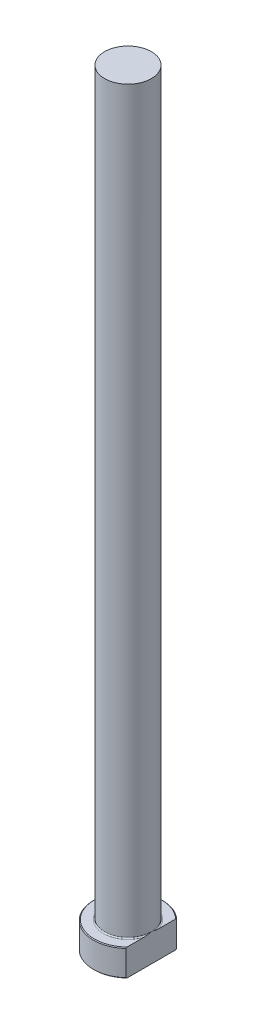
ISO-10303-21;
HEADER;
FILE_DESCRIPTION(('STEP AP214'),'2;1');
FILE_NAME('part.step','',(''),(''),'','','');
FILE_SCHEMA(('AUTOMOTIVE_DESIGN { 1 0 10303 214 1 1 1 1 }'));
ENDSEC;
DATA;
#1=APPLICATION_CONTEXT('core data for automotive mechanical design processes');
#2=APPLICATION_PROTOCOL_DEFINITION('international standard','automotive_design',2000,#1);
#3=PRODUCT_CONTEXT('',#1,'mechanical');
#4=PRODUCT('Part','Part','',(#3));
#5=PRODUCT_RELATED_PRODUCT_CATEGORY('part','',(#4));
#6=PRODUCT_DEFINITION_FORMATION('','',#4);
#7=PRODUCT_DEFINITION_CONTEXT('part definition',#1,'design');
#8=PRODUCT_DEFINITION('design','',#6,#7);
#9=PRODUCT_DEFINITION_SHAPE('','',#8);
#10=(LENGTH_UNIT() NAMED_UNIT(*) SI_UNIT(.MILLI.,.METRE.));
#11=(NAMED_UNIT(*) PLANE_ANGLE_UNIT() SI_UNIT($,.RADIAN.));
#12=(NAMED_UNIT(*) SI_UNIT($,.STERADIAN.) SOLID_ANGLE_UNIT());
#13=UNCERTAINTY_MEASURE_WITH_UNIT(LENGTH_MEASURE(1.E-05),#10,'distance_accuracy_value','');
#14=(GEOMETRIC_REPRESENTATION_CONTEXT(3) GLOBAL_UNCERTAINTY_ASSIGNED_CONTEXT((#13)) GLOBAL_UNIT_ASSIGNED_CONTEXT((#10,
#11,#12)) REPRESENTATION_CONTEXT('',''));
#15=CARTESIAN_POINT('',(0.,0.,0.));
#16=DIRECTION('',(0.,0.,1.));
#17=DIRECTION('',(1.,0.,0.));
#18=AXIS2_PLACEMENT_3D('',#15,#16,#17);
#19=CARTESIAN_POINT('',(0.,0.,0.));
#20=DIRECTION('',(0.,-1.,0.));
#21=DIRECTION('',(0.,0.,-1.));
#22=AXIS2_PLACEMENT_3D('',#19,#20,#21);
#23=PLANE('',#22);
#24=CARTESIAN_POINT('',(0.,0.,0.));
#25=DIRECTION('',(0.,-1.,0.));
#26=DIRECTION('',(0.,0.,-1.));
#27=AXIS2_PLACEMENT_3D('',#24,#25,#26);
#28=CIRCLE('',#27,8.79999999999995);
#29=CARTESIAN_POINT('',(6.09999999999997,0.,6.34271235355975));
#30=VERTEX_POINT('',#29);
#31=CARTESIAN_POINT('',(6.09999999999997,0.,-6.34271235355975));
#32=VERTEX_POINT('',#31);
#33=EDGE_CURVE('E98',#30,#32,#28,.T.);
#34=ORIENTED_EDGE('',*,*,#33,.T.);
#35=DIRECTION('',(0.,0.,1.));
#36=VECTOR('',#35,1.);
#37=CARTESIAN_POINT('',(6.09999999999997,0.,-6.61740130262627));
#38=LINE('',#37,#36);
#39=EDGE_CURVE('E83',#32,#30,#38,.T.);
#40=ORIENTED_EDGE('',*,*,#39,.T.);
#41=EDGE_LOOP('',(#34,#40));
#42=FACE_BOUND('',#41,.T.);
#43=ADVANCED_FACE('F32',(#42),#23,.T.);
#44=CARTESIAN_POINT('',(0.,259.958771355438,0.));
#45=DIRECTION('',(0.,1.,0.));
#46=DIRECTION('',(0.,0.,1.));
#47=AXIS2_PLACEMENT_3D('',#44,#45,#46);
#48=CYLINDRICAL_SURFACE('',#47,8.99999999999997);
#49=CARTESIAN_POINT('',(0.,6.80000000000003,0.));
#50=DIRECTION('',(0.,1.,0.));
#51=DIRECTION('',(0.,0.,1.));
#52=AXIS2_PLACEMENT_3D('',#49,#50,#51);
#53=CIRCLE('',#52,8.99999999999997);
#54=CARTESIAN_POINT('',(6.09999999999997,6.80000000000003,6.61740130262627));
#55=VERTEX_POINT('',#54);
#56=CARTESIAN_POINT('',(6.09999999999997,6.80000000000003,-6.61740130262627));
#57=VERTEX_POINT('',#56);
#58=EDGE_CURVE('E104',#55,#57,#53,.F.);
#59=ORIENTED_EDGE('',*,*,#58,.T.);
#60=DIRECTION('',(0.,-1.,0.));
#61=VECTOR('',#60,1.);
#62=CARTESIAN_POINT('',(6.09999999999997,200.,-6.61740130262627));
#63=LINE('',#62,#61);
#64=CARTESIAN_POINT('',(6.09999999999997,0.200000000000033,-6.61740130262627));
#65=VERTEX_POINT('',#64);
#66=EDGE_CURVE('E183',#57,#65,#63,.T.);
#67=ORIENTED_EDGE('',*,*,#66,.T.);
#68=CARTESIAN_POINT('',(0.,0.200000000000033,0.));
#69=DIRECTION('',(0.,-1.,0.));
#70=DIRECTION('',(0.,0.,-1.));
#71=AXIS2_PLACEMENT_3D('',#68,#69,#70);
#72=CIRCLE('',#71,8.99999999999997);
#73=CARTESIAN_POINT('',(6.09999999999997,0.200000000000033,6.61740130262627));
#74=VERTEX_POINT('',#73);
#75=EDGE_CURVE('E100',#65,#74,#72,.F.);
#76=ORIENTED_EDGE('',*,*,#75,.T.);
#77=DIRECTION('',(0.,-1.,0.));
#78=VECTOR('',#77,1.);
#79=CARTESIAN_POINT('',(6.09999999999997,200.,6.61740130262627));
#80=LINE('',#79,#78);
#81=EDGE_CURVE('E93',#55,#74,#80,.T.);
#82=ORIENTED_EDGE('',*,*,#81,.F.);
#83=EDGE_LOOP('',(#59,#67,#76,#82));
#84=FACE_BOUND('',#83,.T.);
#85=ADVANCED_FACE('F158',(#84),#48,.T.);
#86=CARTESIAN_POINT('',(-8.99999999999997,7.,0.));
#87=DIRECTION('',(0.,1.,0.));
#88=DIRECTION('',(0.,0.,1.));
#89=AXIS2_PLACEMENT_3D('',#86,#87,#88);
#90=PLANE('',#89);
#91=CARTESIAN_POINT('',(0.,7.,0.));
#92=DIRECTION('',(0.,1.,0.));
#93=DIRECTION('',(0.,0.,1.));
#94=AXIS2_PLACEMENT_3D('',#91,#92,#93);
#95=CIRCLE('',#94,8.79999999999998);
#96=CARTESIAN_POINT('',(6.09999999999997,7.,-6.3427123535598));
#97=VERTEX_POINT('',#96);
#98=CARTESIAN_POINT('',(6.09999999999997,7.,6.3427123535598));
#99=VERTEX_POINT('',#98);
#100=EDGE_CURVE('E178',#97,#99,#95,.T.);
#101=ORIENTED_EDGE('',*,*,#100,.T.);
#102=DIRECTION('',(0.,0.,-1.));
#103=VECTOR('',#102,1.);
#104=CARTESIAN_POINT('',(6.09999999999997,7.,0.));
#105=LINE('',#104,#103);
#106=CARTESIAN_POINT('',(6.09999999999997,6.99999999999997,1.9364916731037));
#107=VERTEX_POINT('',#106);
#108=EDGE_CURVE('E57',#99,#107,#105,.T.);
#109=ORIENTED_EDGE('',*,*,#108,.T.);
#110=CARTESIAN_POINT('',(0.,7.,0.));
#111=DIRECTION('',(0.,1.,0.));
#112=DIRECTION('',(0.,0.,1.));
#113=AXIS2_PLACEMENT_3D('',#110,#111,#112);
#114=CIRCLE('',#113,6.39999999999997);
#115=CARTESIAN_POINT('',(6.09999999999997,6.99999999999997,-1.9364916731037));
#116=VERTEX_POINT('',#115);
#117=EDGE_CURVE('E107',#107,#116,#114,.F.);
#118=ORIENTED_EDGE('',*,*,#117,.T.);
#119=EDGE_CURVE('E136',#116,#97,#105,.T.);
#120=ORIENTED_EDGE('',*,*,#119,.T.);
#121=EDGE_LOOP('',(#101,#109,#118,#120));
#122=FACE_BOUND('',#121,.T.);
#123=ADVANCED_FACE('F147',(#122),#90,.T.);
#124=CARTESIAN_POINT('',(0.,7.00000000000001,0.));
#125=DIRECTION('',(0.,-1.,0.));
#126=DIRECTION('',(0.,0.,-1.));
#127=AXIS2_PLACEMENT_3D('',#124,#125,#126);
#128=CONICAL_SURFACE('',#127,8.79999999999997,0.785398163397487);
#129=ORIENTED_EDGE('',*,*,#58,.F.);
#130=CARTESIAN_POINT('',(6.09999999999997,0.0143792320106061,14.5593895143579));
#131=CARTESIAN_POINT('',(6.09999999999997,0.214324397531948,14.3426005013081));
#132=CARTESIAN_POINT('',(6.09999999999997,0.413913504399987,14.1254831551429));
#133=CARTESIAN_POINT('',(6.09999999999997,0.812271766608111,13.6904946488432));
#134=CARTESIAN_POINT('',(6.09999999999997,1.01104091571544,13.4726234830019));
#135=CARTESIAN_POINT('',(6.09999999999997,1.60603894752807,12.8176429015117));
#136=CARTESIAN_POINT('',(6.09999999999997,2.00087078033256,12.3792612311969));
#137=CARTESIAN_POINT('',(6.09999999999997,2.78792222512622,11.4954287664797));
#138=CARTESIAN_POINT('',(6.09999999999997,3.18011200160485,11.0499513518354));
#139=CARTESIAN_POINT('',(6.09999999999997,3.95753447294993,10.1530375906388));
#140=CARTESIAN_POINT('',(6.09999999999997,4.34276798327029,9.70160195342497));
#141=CARTESIAN_POINT('',(6.09999999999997,5.03085646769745,8.87725822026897));
#142=CARTESIAN_POINT('',(6.09999999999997,5.33541849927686,8.50578180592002));
#143=CARTESIAN_POINT('',(6.09999999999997,5.78551221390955,7.94308202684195));
#144=CARTESIAN_POINT('',(6.09999999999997,5.93443884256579,7.75457459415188));
#145=CARTESIAN_POINT('',(6.09999999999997,6.2295750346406,7.37544710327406));
#146=CARTESIAN_POINT('',(6.09999999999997,6.375784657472,7.18482709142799));
#147=CARTESIAN_POINT('',(6.09999999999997,6.6647890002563,6.80131984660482));
#148=CARTESIAN_POINT('',(6.09999999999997,6.80758709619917,6.60843516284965));
#149=CARTESIAN_POINT('',(6.09999999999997,7.08920912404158,6.21979246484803));
#150=CARTESIAN_POINT('',(6.09999999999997,7.22803324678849,6.02403458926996));
#151=CARTESIAN_POINT('',(6.09999999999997,7.50074563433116,5.62920968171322));
#152=CARTESIAN_POINT('',(6.09999999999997,7.63463576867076,5.43014394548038));
#153=CARTESIAN_POINT('',(6.09999999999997,7.89632379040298,5.02806147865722));
#154=CARTESIAN_POINT('',(6.09999999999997,8.02412236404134,4.82504519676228));
#155=CARTESIAN_POINT('',(6.09999999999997,8.27075787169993,4.41652900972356));
#156=CARTESIAN_POINT('',(6.09999999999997,8.38967506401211,4.2110778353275));
#157=CARTESIAN_POINT('',(6.09999999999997,8.61801299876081,3.79489291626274));
#158=CARTESIAN_POINT('',(6.09999999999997,8.72743269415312,3.58415859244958));
#159=CARTESIAN_POINT('',(6.09999999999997,8.93404173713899,3.15694629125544));
#160=CARTESIAN_POINT('',(6.09999999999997,9.03124152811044,2.94047341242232));
#161=CARTESIAN_POINT('',(6.09999999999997,9.2101757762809,2.50119284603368));
#162=CARTESIAN_POINT('',(6.09999999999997,9.29191471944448,2.27838701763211));
#163=CARTESIAN_POINT('',(6.09999999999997,9.42038701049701,1.87551854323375));
#164=CARTESIAN_POINT('',(6.09999999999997,9.47086768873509,1.69665770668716));
#165=CARTESIAN_POINT('',(6.09999999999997,9.55795989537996,1.33556522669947));
#166=CARTESIAN_POINT('',(6.09999999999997,9.59457323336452,1.15333402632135));
#167=CARTESIAN_POINT('',(6.09999999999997,9.65210004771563,0.786944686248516));
#168=CARTESIAN_POINT('',(6.09999999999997,9.6730611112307,0.602794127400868));
#169=CARTESIAN_POINT('',(6.09999999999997,9.69831980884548,0.233342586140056));
#170=CARTESIAN_POINT('',(6.09999999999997,9.70261818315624,0.0480416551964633));
#171=CARTESIAN_POINT('',(6.09999999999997,9.69429534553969,-0.32248570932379));
#172=CARTESIAN_POINT('',(6.09999999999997,9.68164564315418,-0.507711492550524));
#173=CARTESIAN_POINT('',(6.09999999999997,9.64009976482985,-0.876317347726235));
#174=CARTESIAN_POINT('',(6.09999999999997,9.61120224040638,-1.05969726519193));
#175=CARTESIAN_POINT('',(6.09999999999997,9.53854055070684,-1.42403078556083));
#176=CARTESIAN_POINT('',(6.09999999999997,9.49473105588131,-1.60497522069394));
#177=CARTESIAN_POINT('',(6.09999999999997,9.39417906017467,-1.96319042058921));
#178=CARTESIAN_POINT('',(6.09999999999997,9.33743624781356,-2.14046109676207));
#179=CARTESIAN_POINT('',(6.09999999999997,9.20325707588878,-2.51852539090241));
#180=CARTESIAN_POINT('',(6.09999999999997,9.1239718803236,-2.71865799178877));
#181=CARTESIAN_POINT('',(6.09999999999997,8.95352574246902,-3.11384323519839));
#182=CARTESIAN_POINT('',(6.09999999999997,8.86235948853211,-3.30889355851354));
#183=CARTESIAN_POINT('',(6.09999999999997,8.67035859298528,-3.69456420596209));
#184=CARTESIAN_POINT('',(6.09999999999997,8.56950736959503,-3.88517621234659));
#185=CARTESIAN_POINT('',(6.09999999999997,8.36017703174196,-4.26210307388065));
#186=CARTESIAN_POINT('',(6.09999999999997,8.25169895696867,-4.44841851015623));
#187=CARTESIAN_POINT('',(6.09999999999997,8.02723055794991,-4.81954803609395));
#188=CARTESIAN_POINT('',(6.09999999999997,7.91116499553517,-5.00431640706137));
#189=CARTESIAN_POINT('',(6.09999999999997,7.67391977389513,-5.3705334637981));
#190=CARTESIAN_POINT('',(6.09999999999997,7.55273998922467,-5.55198206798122));
#191=CARTESIAN_POINT('',(6.09999999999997,7.30632827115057,-5.91182164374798));
#192=CARTESIAN_POINT('',(6.09999999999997,7.1811006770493,-6.09021559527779));
#193=CARTESIAN_POINT('',(6.09999999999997,6.92719024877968,-6.44453156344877));
#194=CARTESIAN_POINT('',(6.09999999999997,6.79850727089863,-6.62045347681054));
#195=CARTESIAN_POINT('',(6.09999999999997,6.40743139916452,-7.14601004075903));
#196=CARTESIAN_POINT('',(6.09999999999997,6.14071269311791,-7.49242581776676));
#197=CARTESIAN_POINT('',(6.09999999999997,5.59909026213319,-8.17880344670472));
#198=CARTESIAN_POINT('',(6.09999999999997,5.32418574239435,-8.51876466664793));
#199=CARTESIAN_POINT('',(6.09999999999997,4.76812622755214,-9.19396082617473));
#200=CARTESIAN_POINT('',(6.09999999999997,4.48696661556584,-9.52919195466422));
#201=CARTESIAN_POINT('',(6.09999999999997,3.92006700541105,-10.1957589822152));
#202=CARTESIAN_POINT('',(6.09999999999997,3.63432692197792,-10.5270948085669));
#203=CARTESIAN_POINT('',(6.09999999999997,3.07379660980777,-11.1700382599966));
#204=CARTESIAN_POINT('',(6.09999999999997,2.79918078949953,-11.4817981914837));
#205=CARTESIAN_POINT('',(6.09999999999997,2.24738477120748,-12.1030461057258));
#206=CARTESIAN_POINT('',(6.09999999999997,1.97020453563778,-12.4125340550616));
#207=CARTESIAN_POINT('',(6.09999999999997,1.41421579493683,-13.0291430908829));
#208=CARTESIAN_POINT('',(6.09999999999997,1.13541061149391,-13.3362671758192));
#209=CARTESIAN_POINT('',(6.09999999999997,0.576091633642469,-13.9489357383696));
#210=CARTESIAN_POINT('',(6.09999999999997,0.295577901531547,-14.2544802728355));
#211=CARTESIAN_POINT('',(6.09999999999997,0.0143792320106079,-14.5593895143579));
#212=B_SPLINE_CURVE_WITH_KNOTS('',3,(#130,#131,#132,#133,#134,#135,#136,#137,#138,#139,#140,
#141,#142,#143,#144,#145,#146,#147,#148,#149,#150,#151,#152,#153,#154,#155,#156,#157,#158,#159,
#160,#161,#162,#163,#164,#165,#166,#167,#168,#169,#170,#171,#172,#173,#174,#175,#176,#177,#178,
#179,#180,#181,#182,#183,#184,#185,#186,#187,#188,#189,#190,#191,#192,#193,#194,#195,#196,#197,
#198,#199,#200,#201,#202,#203,#204,#205,#206,#207,#208,#209,#210,#211),.UNSPECIFIED.,.F.,.F.,(4,
2,2,2,2,2,2,2,2,2,2,2,2,2,2,2,2,2,2,2,2,2,2,2,2,2,2,2,2,2,2,2,2,2,2,2,2,2,2,2,4),(0.,
0.884747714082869,1.76950214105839,3.53939834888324,5.31990146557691,7.10019448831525,
8.54118050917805,9.26187437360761,9.98255246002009,10.7024850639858,11.4223830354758,
12.1420053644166,12.8615464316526,13.5735035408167,14.2855390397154,14.9969618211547,
15.7081778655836,16.2652530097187,16.8222554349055,17.3775574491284,17.9328347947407,
18.4890467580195,19.0453048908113,19.6032692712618,20.1612470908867,20.806558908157,
21.4521602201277,22.0988872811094,22.7455263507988,23.4000191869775,24.0545280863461,
24.7083572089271,25.3622135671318,26.6736120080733,27.9851381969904,29.29766683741,
30.6102199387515,31.8565868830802,33.102972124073,34.3473597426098,35.5917022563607),.UNSPECIFIED.);
#213=EDGE_CURVE('E135',#55,#99,#212,.T.);
#214=ORIENTED_EDGE('',*,*,#213,.T.);
#215=ORIENTED_EDGE('',*,*,#100,.F.);
#216=EDGE_CURVE('E127',#97,#57,#212,.T.);
#217=ORIENTED_EDGE('',*,*,#216,.T.);
#218=EDGE_LOOP('',(#129,#214,#215,#217));
#219=FACE_BOUND('',#218,.T.);
#220=ADVANCED_FACE('F143',(#219),#128,.T.);
#221=CARTESIAN_POINT('',(0.,0.200000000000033,0.));
#222=DIRECTION('',(0.,1.,0.));
#223=DIRECTION('',(0.,0.,1.));
#224=AXIS2_PLACEMENT_3D('',#221,#222,#223);
#225=CONICAL_SURFACE('',#224,8.99999999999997,0.785398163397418);
#226=ORIENTED_EDGE('',*,*,#75,.F.);
#227=CARTESIAN_POINT('',(6.09999999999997,6.9856207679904,-14.5593895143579));
#228=CARTESIAN_POINT('',(6.09999999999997,6.78567560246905,-14.3426005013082));
#229=CARTESIAN_POINT('',(6.09999999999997,6.586086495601,-14.1254831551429));
#230=CARTESIAN_POINT('',(6.09999999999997,6.18772823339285,-13.6904946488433));
#231=CARTESIAN_POINT('',(6.09999999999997,5.98895908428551,-13.472623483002));
#232=CARTESIAN_POINT('',(6.09999999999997,5.39396105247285,-12.8176429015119));
#233=CARTESIAN_POINT('',(6.09999999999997,4.99912921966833,-12.3792612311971));
#234=CARTESIAN_POINT('',(6.09999999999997,4.21207777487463,-11.4954287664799));
#235=CARTESIAN_POINT('',(6.09999999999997,3.81988799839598,-11.0499513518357));
#236=CARTESIAN_POINT('',(6.09999999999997,3.04246552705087,-10.1530375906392));
#237=CARTESIAN_POINT('',(6.09999999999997,2.65723201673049,-9.70160195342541));
#238=CARTESIAN_POINT('',(6.09999999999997,1.96914353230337,-8.87725822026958));
#239=CARTESIAN_POINT('',(6.09999999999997,1.66458150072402,-8.50578180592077));
#240=CARTESIAN_POINT('',(6.09999999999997,1.21448778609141,-7.94308202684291));
#241=CARTESIAN_POINT('',(6.09999999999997,1.0655611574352,-7.7545745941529));
#242=CARTESIAN_POINT('',(6.09999999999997,0.77042496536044,-7.37544710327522));
#243=CARTESIAN_POINT('',(6.09999999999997,0.624215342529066,-7.18482709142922));
#244=CARTESIAN_POINT('',(6.09999999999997,0.335210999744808,-6.8013198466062));
#245=CARTESIAN_POINT('',(6.09999999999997,0.192412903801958,-6.6084351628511));
#246=CARTESIAN_POINT('',(6.09999999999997,-0.0892091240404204,-6.21979246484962));
#247=CARTESIAN_POINT('',(6.09999999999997,-0.228033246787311,-6.02403458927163));
#248=CARTESIAN_POINT('',(6.09999999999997,-0.500745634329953,-5.62920968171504));
#249=CARTESIAN_POINT('',(6.09999999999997,-0.634635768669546,-5.43014394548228));
#250=CARTESIAN_POINT('',(6.09999999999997,-0.896323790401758,-5.02806147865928));
#251=CARTESIAN_POINT('',(6.09999999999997,-1.02412236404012,-4.82504519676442));
#252=CARTESIAN_POINT('',(6.09999999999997,-1.27075787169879,-4.41652900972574));
#253=CARTESIAN_POINT('',(6.09999999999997,-1.38967506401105,-4.21107783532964));
#254=CARTESIAN_POINT('',(6.09999999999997,-1.61801299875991,-3.7948929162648));
#255=CARTESIAN_POINT('',(6.09999999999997,-1.72743269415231,-3.5841585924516));
#256=CARTESIAN_POINT('',(6.09999999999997,-1.93404173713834,-3.15694629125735));
#257=CARTESIAN_POINT('',(6.09999999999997,-2.03124152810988,-2.94047341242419));
#258=CARTESIAN_POINT('',(6.09999999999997,-2.21017577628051,-2.50119284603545));
#259=CARTESIAN_POINT('',(6.09999999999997,-2.29191471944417,-2.27838701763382));
#260=CARTESIAN_POINT('',(6.09999999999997,-2.42038701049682,-1.87551854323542));
#261=CARTESIAN_POINT('',(6.09999999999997,-2.47086768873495,-1.69665770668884));
#262=CARTESIAN_POINT('',(6.09999999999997,-2.55795989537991,-1.33556522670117));
#263=CARTESIAN_POINT('',(6.09999999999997,-2.59457323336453,-1.15333402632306));
#264=CARTESIAN_POINT('',(6.09999999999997,-2.65210004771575,-0.786944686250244));
#265=CARTESIAN_POINT('',(6.09999999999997,-2.67306111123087,-0.602794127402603));
#266=CARTESIAN_POINT('',(6.09999999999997,-2.69831980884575,-0.233342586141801));
#267=CARTESIAN_POINT('',(6.09999999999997,-2.70261818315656,-0.048041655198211));
#268=CARTESIAN_POINT('',(6.09999999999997,-2.69429534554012,0.322485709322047));
#269=CARTESIAN_POINT('',(6.09999999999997,-2.68164564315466,0.507711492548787));
#270=CARTESIAN_POINT('',(6.09999999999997,-2.64009976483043,0.876317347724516));
#271=CARTESIAN_POINT('',(6.09999999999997,-2.611202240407,1.05969726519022));
#272=CARTESIAN_POINT('',(6.09999999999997,-2.53854055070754,1.42403078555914));
#273=CARTESIAN_POINT('',(6.09999999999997,-2.49473105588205,1.60497522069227));
#274=CARTESIAN_POINT('',(6.09999999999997,-2.39417906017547,1.96319042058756));
#275=CARTESIAN_POINT('',(6.09999999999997,-2.3374362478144,2.14046109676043));
#276=CARTESIAN_POINT('',(6.09999999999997,-2.20325707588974,2.51852539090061));
#277=CARTESIAN_POINT('',(6.09999999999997,-2.12397188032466,2.7186579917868));
#278=CARTESIAN_POINT('',(6.09999999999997,-1.9535257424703,3.1138432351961));
#279=CARTESIAN_POINT('',(6.09999999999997,-1.8623594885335,3.30889355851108));
#280=CARTESIAN_POINT('',(6.09999999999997,-1.67035859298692,3.69456420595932));
#281=CARTESIAN_POINT('',(6.09999999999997,-1.56950736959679,3.88517621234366));
#282=CARTESIAN_POINT('',(6.09999999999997,-1.36017703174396,4.26210307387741));
#283=CARTESIAN_POINT('',(6.09999999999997,-1.25169895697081,4.44841851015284));
#284=CARTESIAN_POINT('',(6.09999999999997,-1.02723055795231,4.81954803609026));
#285=CARTESIAN_POINT('',(6.09999999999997,-0.9111649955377,5.00431640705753));
#286=CARTESIAN_POINT('',(6.09999999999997,-0.673919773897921,5.37053346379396));
#287=CARTESIAN_POINT('',(6.09999999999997,-0.552739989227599,5.55198206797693));
#288=CARTESIAN_POINT('',(6.09999999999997,-0.306328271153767,5.9118216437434));
#289=CARTESIAN_POINT('',(6.09999999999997,-0.18110067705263,6.09021559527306));
#290=CARTESIAN_POINT('',(6.09999999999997,0.0728097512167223,6.44453156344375));
#291=CARTESIAN_POINT('',(6.09999999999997,0.201492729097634,6.62045347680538));
#292=CARTESIAN_POINT('',(6.09999999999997,0.592568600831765,7.14601004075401));
#293=CARTESIAN_POINT('',(6.09999999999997,0.859287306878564,7.49242581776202));
#294=CARTESIAN_POINT('',(6.09999999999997,1.40090973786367,8.17880344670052));
#295=CARTESIAN_POINT('',(6.09999999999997,1.67581425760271,8.51876466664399));
#296=CARTESIAN_POINT('',(6.09999999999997,2.23187377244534,9.1939608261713));
#297=CARTESIAN_POINT('',(6.09999999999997,2.51303338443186,9.52919195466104));
#298=CARTESIAN_POINT('',(6.09999999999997,3.07993299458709,10.1957589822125));
#299=CARTESIAN_POINT('',(6.09999999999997,3.36567307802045,10.5270948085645));
#300=CARTESIAN_POINT('',(6.09999999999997,3.92620339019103,11.1700382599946));
#301=CARTESIAN_POINT('',(6.09999999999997,4.20081921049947,11.4817981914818));
#302=CARTESIAN_POINT('',(6.09999999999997,4.75261522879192,12.1030461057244));
#303=CARTESIAN_POINT('',(6.09999999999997,5.02979546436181,12.4125340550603));
#304=CARTESIAN_POINT('',(6.09999999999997,5.58578420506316,13.029143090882));
#305=CARTESIAN_POINT('',(6.09999999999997,5.86458938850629,13.3362671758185));
#306=CARTESIAN_POINT('',(6.09999999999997,6.42390836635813,13.9489357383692));
#307=CARTESIAN_POINT('',(6.09999999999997,6.70442209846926,14.2544802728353));
#308=CARTESIAN_POINT('',(6.09999999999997,6.9856207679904,14.5593895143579));
#309=B_SPLINE_CURVE_WITH_KNOTS('',3,(#227,#228,#229,#230,#231,#232,#233,#234,#235,#236,#237,
#238,#239,#240,#241,#242,#243,#244,#245,#246,#247,#248,#249,#250,#251,#252,#253,#254,#255,#256,
#257,#258,#259,#260,#261,#262,#263,#264,#265,#266,#267,#268,#269,#270,#271,#272,#273,#274,#275,
#276,#277,#278,#279,#280,#281,#282,#283,#284,#285,#286,#287,#288,#289,#290,#291,#292,#293,#294,
#295,#296,#297,#298,#299,#300,#301,#302,#303,#304,#305,#306,#307,#308),.UNSPECIFIED.,.F.,.F.,(4,
2,2,2,2,2,2,2,2,2,2,2,2,2,2,2,2,2,2,2,2,2,2,2,2,2,2,2,2,2,2,2,2,2,2,2,2,2,2,2,4),(0.,
0.884747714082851,1.76950214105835,3.53939834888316,5.31990146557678,7.10019448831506,
8.54118050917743,9.26187437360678,9.98255246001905,10.7024850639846,11.4223830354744,
12.1420053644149,12.8615464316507,13.573503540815,14.285539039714,14.9969618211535,
15.7081778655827,16.2652530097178,16.8222554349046,17.3775574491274,17.9328347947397,
18.4890467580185,19.0453048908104,19.6032692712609,20.1612470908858,20.8065589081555,
21.4521602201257,22.0988872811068,22.7455263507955,23.4000191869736,24.0545280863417,
24.708357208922,25.3622135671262,26.6736120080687,27.9851381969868,29.2976668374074,
30.6102199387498,31.8565868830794,33.102972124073,34.3473597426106,35.5917022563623),.UNSPECIFIED.);
#310=EDGE_CURVE('E86',#65,#32,#309,.T.);
#311=ORIENTED_EDGE('',*,*,#310,.T.);
#312=ORIENTED_EDGE('',*,*,#33,.F.);
#313=EDGE_CURVE('E89',#30,#74,#309,.T.);
#314=ORIENTED_EDGE('',*,*,#313,.T.);
#315=EDGE_LOOP('',(#226,#311,#312,#314));
#316=FACE_BOUND('',#315,.T.);
#317=ADVANCED_FACE('F97',(#316),#225,.T.);
#318=CARTESIAN_POINT('',(0.,7.29999999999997,0.));
#319=DIRECTION('',(0.,1.,0.));
#320=DIRECTION('',(0.,0.,1.));
#321=AXIS2_PLACEMENT_3D('',#318,#319,#320);
#322=TOROIDAL_SURFACE('',#321,6.39999999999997,0.3);
#323=CARTESIAN_POINT('',(6.09999999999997,7.29999999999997,0.));
#324=CARTESIAN_POINT('',(6.09999999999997,7.30000062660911,-8.49340882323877E-11));
#325=CARTESIAN_POINT('',(6.09999999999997,7.30000125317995,-2.89750604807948E-07));
#326=CARTESIAN_POINT('',(6.09999999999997,7.30000241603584,-1.06233729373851E-06));
#327=CARTESIAN_POINT('',(6.09999999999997,7.30000292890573,-1.56598288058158E-06));
#328=CARTESIAN_POINT('',(6.09999999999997,7.30000401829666,-2.78036834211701E-06));
#329=CARTESIAN_POINT('',(6.09999999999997,7.30000457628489,-3.51079357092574E-06));
#330=CARTESIAN_POINT('',(6.09999999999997,7.30000555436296,-5.00545869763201E-06));
#331=CARTESIAN_POINT('',(6.09999999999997,7.30000597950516,-5.76672403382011E-06));
#332=CARTESIAN_POINT('',(6.09999999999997,7.30000761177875,-8.78783125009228E-06));
#333=CARTESIAN_POINT('',(6.09999999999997,7.30000873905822,-1.10951031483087E-05));
#334=CARTESIAN_POINT('',(6.09999999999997,7.30001054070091,-1.56065756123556E-05));
#335=CARTESIAN_POINT('',(6.09999999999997,7.30001124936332,-1.77975625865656E-05));
#336=CARTESIAN_POINT('',(6.09999999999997,7.3000143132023,-2.72682416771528E-05));
#337=CARTESIAN_POINT('',(6.09999999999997,7.30001667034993,-3.45497120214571E-05));
#338=CARTESIAN_POINT('',(6.09999999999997,7.30002005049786,-4.8163199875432E-05));
#339=CARTESIAN_POINT('',(6.09999999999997,7.30002122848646,-5.44561398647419E-05));
#340=CARTESIAN_POINT('',(6.09999999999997,7.30002994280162,-0.000101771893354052));
#341=CARTESIAN_POINT('',(6.09999999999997,7.30003670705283,-0.000142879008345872));
#342=CARTESIAN_POINT('',(6.09999999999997,7.30006629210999,-0.000306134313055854));
#343=CARTESIAN_POINT('',(6.09999999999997,7.30009435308,-0.000427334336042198));
#344=CARTESIAN_POINT('',(6.09999999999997,7.30020422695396,-0.000909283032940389));
#345=CARTESIAN_POINT('',(6.09999999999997,7.30028277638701,-0.00127051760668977));
#346=CARTESIAN_POINT('',(6.09999999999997,7.30059854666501,-0.00271271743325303));
#347=CARTESIAN_POINT('',(6.09999999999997,7.30083994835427,-0.00379303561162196));
#348=CARTESIAN_POINT('',(6.09999999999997,7.30185162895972,-0.00833170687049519));
#349=CARTESIAN_POINT('',(6.09999999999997,7.30261657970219,-0.0117908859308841));
#350=CARTESIAN_POINT('',(6.09999999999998,7.30941584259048,-0.0425231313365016));
#351=CARTESIAN_POINT('',(6.09999999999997,7.31547175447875,-0.0697929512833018));
#352=CARTESIAN_POINT('',(6.09999999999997,7.32730575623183,-0.123231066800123));
#353=CARTESIAN_POINT('',(6.09999999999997,7.33308513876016,-0.149399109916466));
#354=CARTESIAN_POINT('',(6.09999999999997,7.34535810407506,-0.205120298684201));
#355=CARTESIAN_POINT('',(6.09999999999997,7.35184757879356,-0.234674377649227));
#356=CARTESIAN_POINT('',(6.09999999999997,7.36483397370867,-0.294125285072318));
#357=CARTESIAN_POINT('',(6.09999999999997,7.37133017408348,-0.324022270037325));
#358=CARTESIAN_POINT('',(6.09999999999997,7.3868079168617,-0.39575720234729));
#359=CARTESIAN_POINT('',(6.09999999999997,7.39574786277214,-0.437604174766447));
#360=CARTESIAN_POINT('',(6.09999999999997,7.41315372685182,-0.520210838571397));
#361=CARTESIAN_POINT('',(6.09999999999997,7.42162592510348,-0.560969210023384));
#362=CARTESIAN_POINT('',(6.09999999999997,7.44897438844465,-0.694856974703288));
#363=CARTESIAN_POINT('',(6.09999999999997,7.46725806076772,-0.788109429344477));
#364=CARTESIAN_POINT('',(6.09999999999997,7.50173201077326,-0.975940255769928));
#365=CARTESIAN_POINT('',(6.09999999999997,7.51790033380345,-1.07052272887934));
#366=CARTESIAN_POINT('',(6.09999999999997,7.5483609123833,-1.26941791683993));
#367=CARTESIAN_POINT('',(6.09999999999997,7.56231819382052,-1.37378304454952));
#368=CARTESIAN_POINT('',(6.09999999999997,7.58455179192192,-1.58284720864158));
#369=CARTESIAN_POINT('',(6.09999999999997,7.59284552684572,-1.68754421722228));
#370=CARTESIAN_POINT('',(6.09999999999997,7.59905685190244,-1.84322200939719));
#371=CARTESIAN_POINT('',(6.09999999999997,7.60011923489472,-1.89407517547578));
#372=CARTESIAN_POINT('',(6.09999999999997,7.59985882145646,-1.99583446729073));
#373=CARTESIAN_POINT('',(6.09999999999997,7.59853367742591,-2.04674059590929));
#374=CARTESIAN_POINT('',(6.09999999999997,7.59293461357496,-2.14745109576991));
#375=CARTESIAN_POINT('',(6.09999999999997,7.58871621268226,-2.19725829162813));
#376=CARTESIAN_POINT('',(6.09999999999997,7.57652343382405,-2.29636696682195));
#377=CARTESIAN_POINT('',(6.09999999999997,7.56855424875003,-2.34566904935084));
#378=CARTESIAN_POINT('',(6.09999999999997,7.54906685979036,-2.43557410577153));
#379=CARTESIAN_POINT('',(6.09999999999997,7.53830158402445,-2.47632837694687));
#380=CARTESIAN_POINT('',(6.09999999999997,7.51813116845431,-2.53619759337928));
#381=CARTESIAN_POINT('',(6.09999999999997,7.51071988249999,-2.55597892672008));
#382=CARTESIAN_POINT('',(6.09999999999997,7.49420581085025,-2.59481280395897));
#383=CARTESIAN_POINT('',(6.09999999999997,7.48510530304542,-2.61386628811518));
#384=CARTESIAN_POINT('',(6.09999999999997,7.46462437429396,-2.65097502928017));
#385=CARTESIAN_POINT('',(6.09999999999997,7.4532219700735,-2.66901833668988));
#386=CARTESIAN_POINT('',(6.09999999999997,7.42747894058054,-2.70281743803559));
#387=CARTESIAN_POINT('',(6.09999999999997,7.41316603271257,-2.71859257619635));
#388=CARTESIAN_POINT('',(6.09999999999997,7.39059237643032,-2.73744251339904));
#389=CARTESIAN_POINT('',(6.09999999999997,7.38392912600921,-2.74241546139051));
#390=CARTESIAN_POINT('',(6.09999999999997,7.36998483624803,-2.75142973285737));
#391=CARTESIAN_POINT('',(6.09999999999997,7.36270362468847,-2.75547079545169));
#392=CARTESIAN_POINT('',(6.09999999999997,7.34749053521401,-2.76237207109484));
#393=CARTESIAN_POINT('',(6.09999999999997,7.33955232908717,-2.76521867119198));
#394=CARTESIAN_POINT('',(6.09999999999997,7.3232826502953,-2.76936266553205));
#395=CARTESIAN_POINT('',(6.09999999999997,7.3149518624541,-2.7706626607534));
#396=CARTESIAN_POINT('',(6.09999999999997,7.29896440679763,-2.77151083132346));
#397=CARTESIAN_POINT('',(6.09999999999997,7.29131555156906,-2.77120796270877));
#398=CARTESIAN_POINT('',(6.09999999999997,7.27619804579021,-2.76922646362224));
#399=CARTESIAN_POINT('',(6.09999999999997,7.26872952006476,-2.76754690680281));
#400=CARTESIAN_POINT('',(6.09999999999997,7.25296547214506,-2.76260061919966));
#401=CARTESIAN_POINT('',(6.09999999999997,7.24473928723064,-2.75911619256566));
#402=CARTESIAN_POINT('',(6.09999999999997,7.22896148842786,-2.75086515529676));
#403=CARTESIAN_POINT('',(6.09999999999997,7.22141106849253,-2.74609633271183));
#404=CARTESIAN_POINT('',(6.09999999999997,7.20301227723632,-2.73270182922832));
#405=CARTESIAN_POINT('',(6.09999999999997,7.1926580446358,-2.72340416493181));
#406=CARTESIAN_POINT('',(6.09999999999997,7.1734395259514,-2.70338710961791));
#407=CARTESIAN_POINT('',(6.09999999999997,7.1645795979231,-2.69266371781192));
#408=CARTESIAN_POINT('',(6.09999999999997,7.14025540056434,-2.65971164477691));
#409=CARTESIAN_POINT('',(6.09999999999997,7.12651072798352,-2.63622875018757));
#410=CARTESIAN_POINT('',(6.09999999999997,7.10227969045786,-2.58772082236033));
#411=CARTESIAN_POINT('',(6.09999999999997,7.09179747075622,-2.56269387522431));
#412=CARTESIAN_POINT('',(6.09999999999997,7.0688846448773,-2.49991766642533));
#413=CARTESIAN_POINT('',(6.09999999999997,7.05782215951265,-2.46167427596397));
#414=CARTESIAN_POINT('',(6.09999999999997,7.03925041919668,-2.38430824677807));
#415=CARTESIAN_POINT('',(6.09999999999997,7.03174899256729,-2.34518386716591));
#416=CARTESIAN_POINT('',(6.09999999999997,7.01934937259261,-2.26583226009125));
#417=CARTESIAN_POINT('',(6.09999999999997,7.01449904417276,-2.22559771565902));
#418=CARTESIAN_POINT('',(6.09999999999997,7.00701943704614,-2.14499086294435));
#419=CARTESIAN_POINT('',(6.09999999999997,7.00438710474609,-2.10461882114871));
#420=CARTESIAN_POINT('',(6.09999999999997,6.99952969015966,-1.99154987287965));
#421=CARTESIAN_POINT('',(6.09999999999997,6.99930606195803,-1.91876811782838));
#422=CARTESIAN_POINT('',(6.09999999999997,7.00309053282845,-1.77330138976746));
#423=CARTESIAN_POINT('',(6.09999999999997,7.00710151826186,-1.70061651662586));
#424=CARTESIAN_POINT('',(6.09999999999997,7.01839350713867,-1.55515240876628));
#425=CARTESIAN_POINT('',(6.09999999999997,7.02569039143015,-1.4823744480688));
#426=CARTESIAN_POINT('',(6.09999999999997,7.0428282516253,-1.33711517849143));
#427=CARTESIAN_POINT('',(6.09999999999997,7.05266964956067,-1.2646339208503));
#428=CARTESIAN_POINT('',(6.09999999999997,7.08305970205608,-1.06158751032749));
#429=CARTESIAN_POINT('',(6.09999999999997,7.1058392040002,-0.931360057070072));
#430=CARTESIAN_POINT('',(6.09999999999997,7.15498382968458,-0.6732160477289));
#431=CARTESIAN_POINT('',(6.09999999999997,7.18130321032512,-0.545290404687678));
#432=CARTESIAN_POINT('',(6.09999999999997,7.2144838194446,-0.38980494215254));
#433=CARTESIAN_POINT('',(6.09999999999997,7.22045276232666,-0.362051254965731));
#434=CARTESIAN_POINT('',(6.09999999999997,7.23263801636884,-0.305748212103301));
#435=CARTESIAN_POINT('',(6.09999999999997,7.2388564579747,-0.277199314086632));
#436=CARTESIAN_POINT('',(6.09999999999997,7.25406223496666,-0.207696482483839));
#437=CARTESIAN_POINT('',(6.09999999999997,7.26307730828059,-0.166748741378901));
#438=CARTESIAN_POINT('',(6.09999999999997,7.28028241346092,-0.0889531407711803));
#439=CARTESIAN_POINT('',(6.09999999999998,7.28846503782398,-0.052103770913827));
#440=CARTESIAN_POINT('',(6.09999999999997,7.29738224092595,-0.0117959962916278));
#441=CARTESIAN_POINT('',(6.09999999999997,7.2981461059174,-0.00834194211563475));
#442=CARTESIAN_POINT('',(6.09999999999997,7.29915753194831,-0.0038044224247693));
#443=CARTESIAN_POINT('',(6.09999999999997,7.29939981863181,-0.00272013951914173));
#444=CARTESIAN_POINT('',(6.09999999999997,7.29971666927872,-0.00127300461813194));
#445=CARTESIAN_POINT('',(6.09999999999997,7.29979542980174,-0.000910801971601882));
#446=CARTESIAN_POINT('',(6.09999999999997,7.29990555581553,-0.000427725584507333));
#447=CARTESIAN_POINT('',(6.09999999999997,7.29993365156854,-0.000306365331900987));
#448=CARTESIAN_POINT('',(6.09999999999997,7.29996326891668,-0.000142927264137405));
#449=CARTESIAN_POINT('',(6.09999999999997,7.29997003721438,-0.000101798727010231));
#450=CARTESIAN_POINT('',(6.09999999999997,7.29997875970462,-5.44609821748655E-05));
#451=CARTESIAN_POINT('',(6.09999999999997,7.29997993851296,-4.81669455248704E-05));
#452=CARTESIAN_POINT('',(6.09999999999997,7.29998332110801,-3.45511307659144E-05));
#453=CARTESIAN_POINT('',(6.09999999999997,7.29998568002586,-2.726848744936E-05));
#454=CARTESIAN_POINT('',(6.09999999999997,7.2999887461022,-1.77965710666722E-05));
#455=CARTESIAN_POINT('',(6.09999999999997,7.29998945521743,-1.5605504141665E-05));
#456=CARTESIAN_POINT('',(6.09999999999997,7.29999125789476,-1.10939383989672E-05));
#457=CARTESIAN_POINT('',(6.09999999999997,7.29999238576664,-8.78666464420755E-06));
#458=CARTESIAN_POINT('',(6.09999999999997,7.29999401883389,-5.76563104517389E-06));
#459=CARTESIAN_POINT('',(6.09999999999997,7.2999944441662,-5.00441018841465E-06));
#460=CARTESIAN_POINT('',(6.09999999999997,7.29999542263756,-3.50986831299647E-06));
#461=CARTESIAN_POINT('',(6.09999999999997,7.29999598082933,-2.77952359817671E-06));
#462=CARTESIAN_POINT('',(6.09999999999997,7.29999707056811,-1.56532290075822E-06));
#463=CARTESIAN_POINT('',(6.09999999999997,7.29999758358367,-1.06177376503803E-06));
#464=CARTESIAN_POINT('',(6.09999999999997,7.29999874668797,-2.89436475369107E-07));
#465=CARTESIAN_POINT('',(6.09999999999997,7.29999937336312,8.49378445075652E-11));
#466=CARTESIAN_POINT('',(6.09999999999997,7.29999999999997,0.));
#467=B_SPLINE_CURVE_WITH_KNOTS('',3,(#323,#324,#325,#326,#327,#328,#329,#330,#331,#332,#333,
#334,#335,#336,#337,#338,#339,#340,#341,#342,#343,#344,#345,#346,#347,#348,#349,#350,#351,#352,
#353,#354,#355,#356,#357,#358,#359,#360,#361,#362,#363,#364,#365,#366,#367,#368,#369,#370,#371,
#372,#373,#374,#375,#376,#377,#378,#379,#380,#381,#382,#383,#384,#385,#386,#387,#388,#389,#390,
#391,#392,#393,#394,#395,#396,#397,#398,#399,#400,#401,#402,#403,#404,#405,#406,#407,#408,#409,
#410,#411,#412,#413,#414,#415,#416,#417,#418,#419,#420,#421,#422,#423,#424,#425,#426,#427,#428,
#429,#430,#431,#432,#433,#434,#435,#436,#437,#438,#439,#440,#441,#442,#443,#444,#445,#446,#447,
#448,#449,#450,#451,#452,#453,#454,#455,#456,#457,#458,#459,#460,#461,#462,#463,#464,#465,#466),
.UNSPECIFIED.,.T.,.F.,(4,2,2,2,2,2,2,2,2,2,2,2,2,2,2,2,2,2,2,2,2,2,2,2,2,2,2,2,2,2,2,2,2,2,2,2,
2,2,2,2,2,2,2,2,2,2,2,2,2,2,2,2,2,2,2,2,2,2,2,2,2,2,2,2,2,2,2,2,2,2,2,4),(0.,
1.91250960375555E-06,4.08178522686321E-06,6.8194531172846E-06,9.4346481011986E-06,
1.71137963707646E-05,2.40155063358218E-05,4.6944459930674E-05,6.61299340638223E-05,
0.000191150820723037,0.00056409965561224,0.00167341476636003,0.00499394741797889,
0.015622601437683,0.0994231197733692,0.179819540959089,0.270593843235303,0.362377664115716,
0.49075076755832,0.6156392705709,0.900704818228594,1.18852716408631,1.50431807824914,
1.81913334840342,1.97168386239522,2.12438445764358,2.27423396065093,2.4238766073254,
2.55004267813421,2.61335958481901,2.67659172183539,2.74045901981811,2.80374440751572,
2.82862908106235,2.85352071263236,2.87868879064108,2.90381448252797,2.92664866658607,
2.94949822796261,2.97615207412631,3.00285211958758,3.04436429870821,3.0859955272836,
3.16716680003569,3.24844079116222,3.36758630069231,3.48699253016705,3.60848882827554,
3.72981758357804,3.94797165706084,4.16627452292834,4.38564396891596,4.60504982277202,
5.00154620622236,5.3933388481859,5.47850384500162,5.56615847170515,5.69194439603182,
5.80518254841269,5.81579547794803,5.81912819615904,5.82024048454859,5.82061392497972,
5.82073901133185,5.82075820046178,5.82078113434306,5.82078803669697,5.82079571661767,
5.82079833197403,5.820801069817,5.82080323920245,5.82080515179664),.UNSPECIFIED.);
#468=CARTESIAN_POINT('',(6.09999999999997,7.29999999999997,0.));
#469=VERTEX_POINT('',#468);
#470=EDGE_CURVE('E11',#116,#469,#467,.T.);
#471=ORIENTED_EDGE('',*,*,#470,.F.);
#472=ORIENTED_EDGE('',*,*,#117,.F.);
#473=CARTESIAN_POINT('',(6.09999999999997,7.29999999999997,0.));
#474=CARTESIAN_POINT('',(6.09999999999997,7.29999937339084,8.49339302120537E-11));
#475=CARTESIAN_POINT('',(6.09999999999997,7.29999874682,2.89750604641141E-07));
#476=CARTESIAN_POINT('',(6.09999999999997,7.29999758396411,1.06233729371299E-06));
#477=CARTESIAN_POINT('',(6.09999999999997,7.29999707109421,1.56598288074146E-06));
#478=CARTESIAN_POINT('',(6.09999999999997,7.29999598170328,2.78036834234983E-06));
#479=CARTESIAN_POINT('',(6.09999999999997,7.29999542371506,3.51079357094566E-06));
#480=CARTESIAN_POINT('',(6.09999999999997,7.29999444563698,5.00545869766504E-06));
#481=CARTESIAN_POINT('',(6.09999999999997,7.29999402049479,5.76672403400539E-06));
#482=CARTESIAN_POINT('',(6.09999999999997,7.2999923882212,8.78783125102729E-06));
#483=CARTESIAN_POINT('',(6.09999999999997,7.29999126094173,1.10951031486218E-05));
#484=CARTESIAN_POINT('',(6.09999999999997,7.29998945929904,1.56065756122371E-05));
#485=CARTESIAN_POINT('',(6.09999999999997,7.29998875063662,1.77975625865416E-05));
#486=CARTESIAN_POINT('',(6.09999999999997,7.29998568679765,2.72682416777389E-05));
#487=CARTESIAN_POINT('',(6.09999999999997,7.29998332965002,3.45497120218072E-05));
#488=CARTESIAN_POINT('',(6.09999999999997,7.29997994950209,4.81631998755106E-05));
#489=CARTESIAN_POINT('',(6.09999999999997,7.29997877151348,5.44561398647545E-05));
#490=CARTESIAN_POINT('',(6.09999999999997,7.29997005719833,0.000101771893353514));
#491=CARTESIAN_POINT('',(6.09999999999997,7.29996329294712,0.000142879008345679));
#492=CARTESIAN_POINT('',(6.09999999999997,7.29993370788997,0.000306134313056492));
#493=CARTESIAN_POINT('',(6.09999999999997,7.29990564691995,0.000427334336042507));
#494=CARTESIAN_POINT('',(6.09999999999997,7.29979577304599,0.000909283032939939));
#495=CARTESIAN_POINT('',(6.09999999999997,7.29971722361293,0.00127051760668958));
#496=CARTESIAN_POINT('',(6.09999999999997,7.29940145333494,0.00271271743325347));
#497=CARTESIAN_POINT('',(6.09999999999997,7.29916005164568,0.00379303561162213));
#498=CARTESIAN_POINT('',(6.09999999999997,7.29814837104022,0.00833170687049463));
#499=CARTESIAN_POINT('',(6.09999999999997,7.29738342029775,0.0117908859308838));
#500=CARTESIAN_POINT('',(6.09999999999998,7.29058415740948,0.0425231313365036));
#501=CARTESIAN_POINT('',(6.09999999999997,7.2845282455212,0.0697929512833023));
#502=CARTESIAN_POINT('',(6.09999999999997,7.27269424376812,0.123231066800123));
#503=CARTESIAN_POINT('',(6.09999999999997,7.26691486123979,0.149399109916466));
#504=CARTESIAN_POINT('',(6.09999999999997,7.25464189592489,0.205120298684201));
#505=CARTESIAN_POINT('',(6.09999999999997,7.24815242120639,0.234674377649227));
#506=CARTESIAN_POINT('',(6.09999999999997,7.23516602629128,0.294125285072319));
#507=CARTESIAN_POINT('',(6.09999999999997,7.22866982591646,0.324022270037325));
#508=CARTESIAN_POINT('',(6.09999999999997,7.21319208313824,0.39575720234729));
#509=CARTESIAN_POINT('',(6.09999999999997,7.2042521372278,0.437604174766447));
#510=CARTESIAN_POINT('',(6.09999999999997,7.18684627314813,0.520210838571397));
#511=CARTESIAN_POINT('',(6.09999999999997,7.17837407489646,0.560969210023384));
#512=CARTESIAN_POINT('',(6.09999999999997,7.1510256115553,0.694856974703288));
#513=CARTESIAN_POINT('',(6.09999999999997,7.13274193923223,0.788109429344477));
#514=CARTESIAN_POINT('',(6.09999999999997,7.09826798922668,0.975940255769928));
#515=CARTESIAN_POINT('',(6.09999999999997,7.0820996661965,1.07052272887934));
#516=CARTESIAN_POINT('',(6.09999999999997,7.05163908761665,1.26941791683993));
#517=CARTESIAN_POINT('',(6.09999999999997,7.03768180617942,1.37378304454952));
#518=CARTESIAN_POINT('',(6.09999999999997,7.01544820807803,1.58284720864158));
#519=CARTESIAN_POINT('',(6.09999999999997,7.00715447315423,1.68754421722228));
#520=CARTESIAN_POINT('',(6.09999999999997,7.0009431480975,1.84322200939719));
#521=CARTESIAN_POINT('',(6.09999999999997,6.99988076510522,1.89407517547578));
#522=CARTESIAN_POINT('',(6.09999999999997,7.00014117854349,1.99583446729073));
#523=CARTESIAN_POINT('',(6.09999999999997,7.00146632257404,2.04674059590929));
#524=CARTESIAN_POINT('',(6.09999999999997,7.00706538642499,2.14745109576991));
#525=CARTESIAN_POINT('',(6.09999999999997,7.01128378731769,2.19725829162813));
#526=CARTESIAN_POINT('',(6.09999999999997,7.0234765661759,2.29636696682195));
#527=CARTESIAN_POINT('',(6.09999999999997,7.03144575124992,2.34566904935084));
#528=CARTESIAN_POINT('',(6.09999999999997,7.05093314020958,2.43557410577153));
#529=CARTESIAN_POINT('',(6.09999999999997,7.06169841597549,2.47632837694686));
#530=CARTESIAN_POINT('',(6.09999999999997,7.08186883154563,2.53619759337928));
#531=CARTESIAN_POINT('',(6.09999999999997,7.08928011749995,2.55597892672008));
#532=CARTESIAN_POINT('',(6.09999999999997,7.1057941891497,2.59481280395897));
#533=CARTESIAN_POINT('',(6.09999999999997,7.11489469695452,2.61386628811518));
#534=CARTESIAN_POINT('',(6.09999999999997,7.13537562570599,2.65097502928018));
#535=CARTESIAN_POINT('',(6.09999999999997,7.14677802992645,2.66901833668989));
#536=CARTESIAN_POINT('',(6.09999999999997,7.17252105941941,2.70281743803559));
#537=CARTESIAN_POINT('',(6.09999999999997,7.18683396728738,2.71859257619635));
#538=CARTESIAN_POINT('',(6.09999999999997,7.20940762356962,2.73744251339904));
#539=CARTESIAN_POINT('',(6.09999999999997,7.21607087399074,2.74241546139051));
#540=CARTESIAN_POINT('',(6.09999999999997,7.23001516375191,2.75142973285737));
#541=CARTESIAN_POINT('',(6.09999999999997,7.23729637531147,2.75547079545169));
#542=CARTESIAN_POINT('',(6.09999999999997,7.25250946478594,2.76237207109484));
#543=CARTESIAN_POINT('',(6.09999999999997,7.26044767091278,2.76521867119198));
#544=CARTESIAN_POINT('',(6.09999999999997,7.27671734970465,2.76936266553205));
#545=CARTESIAN_POINT('',(6.09999999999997,7.28504813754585,2.7706626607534));
#546=CARTESIAN_POINT('',(6.09999999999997,7.30103559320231,2.77151083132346));
#547=CARTESIAN_POINT('',(6.09999999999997,7.30868444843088,2.77120796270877));
#548=CARTESIAN_POINT('',(6.09999999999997,7.32380195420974,2.76922646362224));
#549=CARTESIAN_POINT('',(6.09999999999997,7.33127047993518,2.76754690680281));
#550=CARTESIAN_POINT('',(6.09999999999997,7.34703452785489,2.76260061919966));
#551=CARTESIAN_POINT('',(6.09999999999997,7.35526071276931,2.75911619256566));
#552=CARTESIAN_POINT('',(6.09999999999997,7.37103851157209,2.75086515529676));
#553=CARTESIAN_POINT('',(6.09999999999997,7.37858893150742,2.74609633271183));
#554=CARTESIAN_POINT('',(6.09999999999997,7.39698772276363,2.73270182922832));
#555=CARTESIAN_POINT('',(6.09999999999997,7.40734195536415,2.72340416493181));
#556=CARTESIAN_POINT('',(6.09999999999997,7.42656047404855,2.70338710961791));
#557=CARTESIAN_POINT('',(6.09999999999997,7.43542040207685,2.69266371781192));
#558=CARTESIAN_POINT('',(6.09999999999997,7.45974459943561,2.65971164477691));
#559=CARTESIAN_POINT('',(6.09999999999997,7.47348927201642,2.63622875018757));
#560=CARTESIAN_POINT('',(6.09999999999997,7.49772030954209,2.58772082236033));
#561=CARTESIAN_POINT('',(6.09999999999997,7.50820252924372,2.56269387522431));
#562=CARTESIAN_POINT('',(6.09999999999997,7.53111535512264,2.49991766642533));
#563=CARTESIAN_POINT('',(6.09999999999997,7.54217784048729,2.46167427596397));
#564=CARTESIAN_POINT('',(6.09999999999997,7.56074958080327,2.38430824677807));
#565=CARTESIAN_POINT('',(6.09999999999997,7.56825100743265,2.34518386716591));
#566=CARTESIAN_POINT('',(6.09999999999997,7.58065062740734,2.26583226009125));
#567=CARTESIAN_POINT('',(6.09999999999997,7.58550095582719,2.22559771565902));
#568=CARTESIAN_POINT('',(6.09999999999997,7.59298056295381,2.14499086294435));
#569=CARTESIAN_POINT('',(6.09999999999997,7.59561289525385,2.10461882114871));
#570=CARTESIAN_POINT('',(6.09999999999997,7.60047030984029,1.99154987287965));
#571=CARTESIAN_POINT('',(6.09999999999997,7.60069393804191,1.91876811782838));
#572=CARTESIAN_POINT('',(6.09999999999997,7.59690946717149,1.77330138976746));
#573=CARTESIAN_POINT('',(6.09999999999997,7.59289848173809,1.70061651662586));
#574=CARTESIAN_POINT('',(6.09999999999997,7.58160649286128,1.55515240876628));
#575=CARTESIAN_POINT('',(6.09999999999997,7.5743096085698,1.4823744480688));
#576=CARTESIAN_POINT('',(6.09999999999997,7.55717174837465,1.33711517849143));
#577=CARTESIAN_POINT('',(6.09999999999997,7.54733035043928,1.2646339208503));
#578=CARTESIAN_POINT('',(6.09999999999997,7.51694029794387,1.06158751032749));
#579=CARTESIAN_POINT('',(6.09999999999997,7.49416079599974,0.931360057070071));
#580=CARTESIAN_POINT('',(6.09999999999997,7.44501617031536,0.673216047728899));
#581=CARTESIAN_POINT('',(6.09999999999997,7.41869678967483,0.545290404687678));
#582=CARTESIAN_POINT('',(6.09999999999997,7.38551618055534,0.38980494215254));
#583=CARTESIAN_POINT('',(6.09999999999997,7.37954723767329,0.362051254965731));
#584=CARTESIAN_POINT('',(6.09999999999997,7.36736198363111,0.305748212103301));
#585=CARTESIAN_POINT('',(6.09999999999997,7.36114354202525,0.277199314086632));
#586=CARTESIAN_POINT('',(6.09999999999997,7.34593776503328,0.20769648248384));
#587=CARTESIAN_POINT('',(6.09999999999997,7.33692269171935,0.166748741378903));
#588=CARTESIAN_POINT('',(6.09999999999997,7.31971758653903,0.0889531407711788));
#589=CARTESIAN_POINT('',(6.09999999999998,7.31153496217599,0.0521037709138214));
#590=CARTESIAN_POINT('',(6.09999999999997,7.302617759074,0.0117959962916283));
#591=CARTESIAN_POINT('',(6.09999999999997,7.30185389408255,0.00834194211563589));
#592=CARTESIAN_POINT('',(6.09999999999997,7.30084246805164,0.00380442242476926));
#593=CARTESIAN_POINT('',(6.09999999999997,7.30060018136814,0.00272013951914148));
#594=CARTESIAN_POINT('',(6.09999999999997,7.30028333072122,0.00127300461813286));
#595=CARTESIAN_POINT('',(6.09999999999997,7.30020457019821,0.000910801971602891));
#596=CARTESIAN_POINT('',(6.09999999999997,7.30009444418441,0.000427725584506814));
#597=CARTESIAN_POINT('',(6.09999999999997,7.30006634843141,0.000306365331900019));
#598=CARTESIAN_POINT('',(6.09999999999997,7.30003673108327,0.000142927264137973));
#599=CARTESIAN_POINT('',(6.09999999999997,7.30002996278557,0.000101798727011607));
#600=CARTESIAN_POINT('',(6.09999999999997,7.30002124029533,5.44609821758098E-05));
#601=CARTESIAN_POINT('',(6.09999999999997,7.30002006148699,4.81669455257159E-05));
#602=CARTESIAN_POINT('',(6.09999999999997,7.30001667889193,3.45511307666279E-05));
#603=CARTESIAN_POINT('',(6.09999999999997,7.30001431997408,2.72684874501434E-05));
#604=CARTESIAN_POINT('',(6.09999999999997,7.30001125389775,1.77965710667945E-05));
#605=CARTESIAN_POINT('',(6.09999999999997,7.30001054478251,1.5605504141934E-05));
#606=CARTESIAN_POINT('',(6.09999999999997,7.30000874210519,1.10939383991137E-05));
#607=CARTESIAN_POINT('',(6.09999999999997,7.30000761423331,8.78666464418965E-06));
#608=CARTESIAN_POINT('',(6.09999999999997,7.30000598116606,5.76563104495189E-06));
#609=CARTESIAN_POINT('',(6.09999999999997,7.30000555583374,5.00441018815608E-06));
#610=CARTESIAN_POINT('',(6.09999999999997,7.30000457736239,3.50986831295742E-06));
#611=CARTESIAN_POINT('',(6.09999999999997,7.30000401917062,2.77952359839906E-06));
#612=CARTESIAN_POINT('',(6.09999999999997,7.30000292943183,1.56532290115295E-06));
#613=CARTESIAN_POINT('',(6.09999999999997,7.30000241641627,1.06177376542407E-06));
#614=CARTESIAN_POINT('',(6.09999999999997,7.30000125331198,2.8943647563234E-07));
#615=CARTESIAN_POINT('',(6.09999999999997,7.30000062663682,-8.49376864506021E-11));
#616=CARTESIAN_POINT('',(6.09999999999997,7.29999999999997,0.));
#617=B_SPLINE_CURVE_WITH_KNOTS('',3,(#473,#474,#475,#476,#477,#478,#479,#480,#481,#482,#483,
#484,#485,#486,#487,#488,#489,#490,#491,#492,#493,#494,#495,#496,#497,#498,#499,#500,#501,#502,
#503,#504,#505,#506,#507,#508,#509,#510,#511,#512,#513,#514,#515,#516,#517,#518,#519,#520,#521,
#522,#523,#524,#525,#526,#527,#528,#529,#530,#531,#532,#533,#534,#535,#536,#537,#538,#539,#540,
#541,#542,#543,#544,#545,#546,#547,#548,#549,#550,#551,#552,#553,#554,#555,#556,#557,#558,#559,
#560,#561,#562,#563,#564,#565,#566,#567,#568,#569,#570,#571,#572,#573,#574,#575,#576,#577,#578,
#579,#580,#581,#582,#583,#584,#585,#586,#587,#588,#589,#590,#591,#592,#593,#594,#595,#596,#597,
#598,#599,#600,#601,#602,#603,#604,#605,#606,#607,#608,#609,#610,#611,#612,#613,#614,#615,#616),
.UNSPECIFIED.,.T.,.F.,(4,2,2,2,2,2,2,2,2,2,2,2,2,2,2,2,2,2,2,2,2,2,2,2,2,2,2,2,2,2,2,2,2,2,2,2,
2,2,2,2,2,2,2,2,2,2,2,2,2,2,2,2,2,2,2,2,2,2,2,2,2,2,2,2,2,2,2,2,2,2,2,4),(0.,
1.91250960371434E-06,4.08178522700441E-06,6.81945311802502E-06,9.43464810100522E-06,
1.71137963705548E-05,2.40155063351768E-05,4.69444599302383E-05,6.61299340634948E-05,
0.00019115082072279,0.000564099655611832,0.00167341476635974,0.0049939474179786,
0.0156226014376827,0.0994231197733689,0.179819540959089,0.270593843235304,0.362377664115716,
0.49075076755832,0.615639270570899,0.900704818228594,1.18852716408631,1.50431807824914,
1.81913334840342,1.97168386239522,2.12438445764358,2.27423396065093,2.4238766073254,
2.5500426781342,2.61335958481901,2.67659172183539,2.74045901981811,2.80374440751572,
2.82862908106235,2.85352071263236,2.87868879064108,2.90381448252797,2.92664866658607,
2.94949822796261,2.97615207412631,3.00285211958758,3.04436429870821,3.0859955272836,
3.16716680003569,3.24844079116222,3.36758630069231,3.48699253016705,3.60848882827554,
3.72981758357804,3.94797165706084,4.16627452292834,4.38564396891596,4.60504982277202,
5.00154620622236,5.3933388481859,5.47850384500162,5.56615847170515,5.69194439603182,
5.80518254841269,5.81579547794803,5.81912819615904,5.82024048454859,5.82061392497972,
5.82073901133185,5.82075820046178,5.82078113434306,5.82078803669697,5.82079571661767,
5.82079833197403,5.820801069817,5.82080323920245,5.82080515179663),.UNSPECIFIED.);
#618=EDGE_CURVE('E46',#469,#107,#617,.T.);
#619=ORIENTED_EDGE('',*,*,#618,.F.);
#620=CARTESIAN_POINT('',(0.,7.29999999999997,0.));
#621=DIRECTION('',(0.,1.,0.));
#622=DIRECTION('',(0.,0.,1.));
#623=AXIS2_PLACEMENT_3D('',#620,#621,#622);
#624=CIRCLE('',#623,6.09999999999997);
#625=EDGE_CURVE('E103',#469,#469,#624,.T.);
#626=ORIENTED_EDGE('',*,*,#625,.F.);
#627=EDGE_LOOP('',(#471,#472,#619,#626));
#628=FACE_BOUND('',#627,.T.);
#629=ADVANCED_FACE('F34',(#628),#322,.F.);
#630=CARTESIAN_POINT('',(0.,259.958771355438,0.));
#631=DIRECTION('',(0.,1.,0.));
#632=DIRECTION('',(0.,0.,1.));
#633=AXIS2_PLACEMENT_3D('',#630,#631,#632);
#634=CYLINDRICAL_SURFACE('',#633,6.09999999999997);
#635=ORIENTED_EDGE('',*,*,#625,.T.);
#636=EDGE_LOOP('',(#635));
#637=FACE_BOUND('',#636,.T.);
#638=CARTESIAN_POINT('',(0.,200.,0.));
#639=DIRECTION('',(0.,1.,0.));
#640=DIRECTION('',(0.,0.,1.));
#641=AXIS2_PLACEMENT_3D('',#638,#639,#640);
#642=CIRCLE('',#641,6.09999999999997);
#643=CARTESIAN_POINT('',(0.,200.,6.09999999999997));
#644=VERTEX_POINT('',#643);
#645=EDGE_CURVE('E101',#644,#644,#642,.T.);
#646=ORIENTED_EDGE('',*,*,#645,.F.);
#647=EDGE_LOOP('',(#646));
#648=FACE_BOUND('',#647,.T.);
#649=ADVANCED_FACE('F155',(#637,#648),#634,.T.);
#650=CARTESIAN_POINT('',(-6.09999999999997,200.,0.));
#651=DIRECTION('',(0.,1.,0.));
#652=DIRECTION('',(0.,0.,1.));
#653=AXIS2_PLACEMENT_3D('',#650,#651,#652);
#654=PLANE('',#653);
#655=ORIENTED_EDGE('',*,*,#645,.T.);
#656=EDGE_LOOP('',(#655));
#657=FACE_BOUND('',#656,.T.);
#658=ADVANCED_FACE('F121',(#657),#654,.T.);
#659=CARTESIAN_POINT('',(6.09999999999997,200.,-6.61740130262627));
#660=DIRECTION('',(1.,0.,0.));
#661=DIRECTION('',(0.,0.,-1.));
#662=AXIS2_PLACEMENT_3D('',#659,#660,#661);
#663=PLANE('',#662);
#664=ORIENTED_EDGE('',*,*,#66,.F.);
#665=ORIENTED_EDGE('',*,*,#216,.F.);
#666=ORIENTED_EDGE('',*,*,#119,.F.);
#667=ORIENTED_EDGE('',*,*,#470,.T.);
#668=ORIENTED_EDGE('',*,*,#618,.T.);
#669=ORIENTED_EDGE('',*,*,#108,.F.);
#670=ORIENTED_EDGE('',*,*,#213,.F.);
#671=ORIENTED_EDGE('',*,*,#81,.T.);
#672=ORIENTED_EDGE('',*,*,#313,.F.);
#673=ORIENTED_EDGE('',*,*,#39,.F.);
#674=ORIENTED_EDGE('',*,*,#310,.F.);
#675=EDGE_LOOP('',(#664,#665,#666,#667,#668,#669,#670,#671,#672,#673,#674));
#676=FACE_BOUND('',#675,.T.);
#677=ADVANCED_FACE('F85',(#676),#663,.T.);
#678=CLOSED_SHELL('',(#43,#85,#123,#220,#317,#629,#649,#658,#677));
#679=MANIFOLD_SOLID_BREP('B2',#678);
#680=ADVANCED_BREP_SHAPE_REPRESENTATION('',(#18,#679),#14);
#681=SHAPE_DEFINITION_REPRESENTATION(#9,#680);
ENDSEC;
END-ISO-10303-21;
